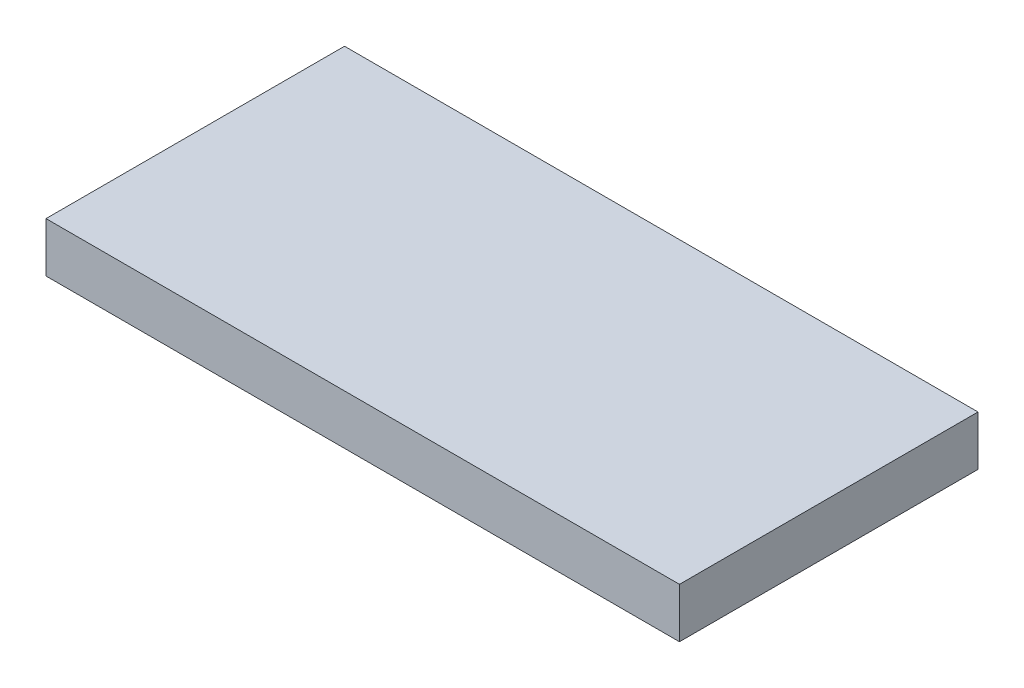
ISO-10303-21;
HEADER;
FILE_DESCRIPTION(('STEP AP214'),'2;1');
FILE_NAME('part.step','',(''),(''),'','','');
FILE_SCHEMA(('AUTOMOTIVE_DESIGN { 1 0 10303 214 1 1 1 1 }'));
ENDSEC;
DATA;
#1=APPLICATION_CONTEXT('core data for automotive mechanical design processes');
#2=APPLICATION_PROTOCOL_DEFINITION('international standard','automotive_design',2000,#1);
#3=PRODUCT_CONTEXT('',#1,'mechanical');
#4=PRODUCT('Part','Part','',(#3));
#5=PRODUCT_RELATED_PRODUCT_CATEGORY('part','',(#4));
#6=PRODUCT_DEFINITION_FORMATION('','',#4);
#7=PRODUCT_DEFINITION_CONTEXT('part definition',#1,'design');
#8=PRODUCT_DEFINITION('design','',#6,#7);
#9=PRODUCT_DEFINITION_SHAPE('','',#8);
#10=(LENGTH_UNIT() NAMED_UNIT(*) SI_UNIT(.MILLI.,.METRE.));
#11=(NAMED_UNIT(*) PLANE_ANGLE_UNIT() SI_UNIT($,.RADIAN.));
#12=(NAMED_UNIT(*) SI_UNIT($,.STERADIAN.) SOLID_ANGLE_UNIT());
#13=UNCERTAINTY_MEASURE_WITH_UNIT(LENGTH_MEASURE(1.E-05),#10,'distance_accuracy_value','');
#14=(GEOMETRIC_REPRESENTATION_CONTEXT(3) GLOBAL_UNCERTAINTY_ASSIGNED_CONTEXT((#13)) GLOBAL_UNIT_ASSIGNED_CONTEXT((#10,
#11,#12)) REPRESENTATION_CONTEXT('',''));
#15=CARTESIAN_POINT('',(0.,0.,0.));
#16=DIRECTION('',(0.,0.,1.));
#17=DIRECTION('',(1.,0.,0.));
#18=AXIS2_PLACEMENT_3D('',#15,#16,#17);
#19=CARTESIAN_POINT('',(646.79957,50.8,-304.8));
#20=DIRECTION('',(-1.,0.,0.));
#21=DIRECTION('',(0.,0.,1.));
#22=AXIS2_PLACEMENT_3D('',#19,#20,#21);
#23=PLANE('',#22);
#24=DIRECTION('',(0.,0.,-1.));
#25=VECTOR('',#24,1.);
#26=CARTESIAN_POINT('',(646.79957,-50.8,-304.8));
#27=LINE('',#26,#25);
#28=CARTESIAN_POINT('',(646.79957,-50.8,304.8));
#29=VERTEX_POINT('',#28);
#30=CARTESIAN_POINT('',(646.79957,-50.8,-304.8));
#31=VERTEX_POINT('',#30);
#32=EDGE_CURVE('E96',#29,#31,#27,.T.);
#33=ORIENTED_EDGE('',*,*,#32,.T.);
#34=DIRECTION('',(0.,-1.,0.));
#35=VECTOR('',#34,1.);
#36=CARTESIAN_POINT('',(646.79957,50.8,-304.8));
#37=LINE('',#36,#35);
#38=CARTESIAN_POINT('',(646.79957,50.8,-304.8));
#39=VERTEX_POINT('',#38);
#40=EDGE_CURVE('E11',#39,#31,#37,.T.);
#41=ORIENTED_EDGE('',*,*,#40,.F.);
#42=DIRECTION('',(0.,0.,-1.));
#43=VECTOR('',#42,1.);
#44=CARTESIAN_POINT('',(646.79957,50.8,-304.8));
#45=LINE('',#44,#43);
#46=CARTESIAN_POINT('',(646.79957,50.8,304.8));
#47=VERTEX_POINT('',#46);
#48=EDGE_CURVE('E84',#47,#39,#45,.T.);
#49=ORIENTED_EDGE('',*,*,#48,.F.);
#50=DIRECTION('',(0.,-1.,0.));
#51=VECTOR('',#50,1.);
#52=CARTESIAN_POINT('',(646.79957,50.8,304.8));
#53=LINE('',#52,#51);
#54=EDGE_CURVE('E92',#47,#29,#53,.T.);
#55=ORIENTED_EDGE('',*,*,#54,.T.);
#56=EDGE_LOOP('',(#33,#41,#49,#55));
#57=FACE_BOUND('',#56,.T.);
#58=ADVANCED_FACE('F33',(#57),#23,.F.);
#59=CARTESIAN_POINT('',(-646.79957,50.8,-304.8));
#60=DIRECTION('',(0.,0.,1.));
#61=DIRECTION('',(1.,0.,0.));
#62=AXIS2_PLACEMENT_3D('',#59,#60,#61);
#63=PLANE('',#62);
#64=DIRECTION('',(-1.,0.,0.));
#65=VECTOR('',#64,1.);
#66=CARTESIAN_POINT('',(-646.79957,-50.8,-304.8));
#67=LINE('',#66,#65);
#68=CARTESIAN_POINT('',(-646.79957,-50.8,-304.8));
#69=VERTEX_POINT('',#68);
#70=EDGE_CURVE('E88',#31,#69,#67,.T.);
#71=ORIENTED_EDGE('',*,*,#70,.T.);
#72=DIRECTION('',(0.,-1.,0.));
#73=VECTOR('',#72,1.);
#74=CARTESIAN_POINT('',(-646.79957,50.8,-304.8));
#75=LINE('',#74,#73);
#76=CARTESIAN_POINT('',(-646.79957,50.8,-304.8));
#77=VERTEX_POINT('',#76);
#78=EDGE_CURVE('E41',#77,#69,#75,.T.);
#79=ORIENTED_EDGE('',*,*,#78,.F.);
#80=DIRECTION('',(-1.,0.,0.));
#81=VECTOR('',#80,1.);
#82=CARTESIAN_POINT('',(-646.79957,50.8,-304.8));
#83=LINE('',#82,#81);
#84=EDGE_CURVE('E79',#39,#77,#83,.T.);
#85=ORIENTED_EDGE('',*,*,#84,.F.);
#86=ORIENTED_EDGE('',*,*,#40,.T.);
#87=EDGE_LOOP('',(#71,#79,#85,#86));
#88=FACE_BOUND('',#87,.T.);
#89=ADVANCED_FACE('F87',(#88),#63,.F.);
#90=CARTESIAN_POINT('',(-646.79957,50.8,-304.8));
#91=DIRECTION('',(1.,0.,0.));
#92=DIRECTION('',(0.,0.,-1.));
#93=AXIS2_PLACEMENT_3D('',#90,#91,#92);
#94=PLANE('',#93);
#95=DIRECTION('',(0.,0.,1.));
#96=VECTOR('',#95,1.);
#97=CARTESIAN_POINT('',(-646.79957,-50.8,-304.8));
#98=LINE('',#97,#96);
#99=CARTESIAN_POINT('',(-646.79957,-50.8,304.8));
#100=VERTEX_POINT('',#99);
#101=EDGE_CURVE('E66',#69,#100,#98,.T.);
#102=ORIENTED_EDGE('',*,*,#101,.T.);
#103=DIRECTION('',(0.,-1.,0.));
#104=VECTOR('',#103,1.);
#105=CARTESIAN_POINT('',(-646.79957,50.8,304.8));
#106=LINE('',#105,#104);
#107=CARTESIAN_POINT('',(-646.79957,50.8,304.8));
#108=VERTEX_POINT('',#107);
#109=EDGE_CURVE('E89',#108,#100,#106,.T.);
#110=ORIENTED_EDGE('',*,*,#109,.F.);
#111=DIRECTION('',(0.,0.,1.));
#112=VECTOR('',#111,1.);
#113=CARTESIAN_POINT('',(-646.79957,50.8,-304.8));
#114=LINE('',#113,#112);
#115=EDGE_CURVE('E82',#77,#108,#114,.T.);
#116=ORIENTED_EDGE('',*,*,#115,.F.);
#117=ORIENTED_EDGE('',*,*,#78,.T.);
#118=EDGE_LOOP('',(#102,#110,#116,#117));
#119=FACE_BOUND('',#118,.T.);
#120=ADVANCED_FACE('F90',(#119),#94,.F.);
#121=CARTESIAN_POINT('',(-646.79957,50.8,304.8));
#122=DIRECTION('',(0.,0.,-1.));
#123=DIRECTION('',(-1.,0.,0.));
#124=AXIS2_PLACEMENT_3D('',#121,#122,#123);
#125=PLANE('',#124);
#126=DIRECTION('',(1.,0.,0.));
#127=VECTOR('',#126,1.);
#128=CARTESIAN_POINT('',(-646.79957,-50.8,304.8));
#129=LINE('',#128,#127);
#130=EDGE_CURVE('E72',#100,#29,#129,.T.);
#131=ORIENTED_EDGE('',*,*,#130,.T.);
#132=ORIENTED_EDGE('',*,*,#54,.F.);
#133=DIRECTION('',(1.,0.,0.));
#134=VECTOR('',#133,1.);
#135=CARTESIAN_POINT('',(-646.79957,50.8,304.8));
#136=LINE('',#135,#134);
#137=EDGE_CURVE('E49',#108,#47,#136,.T.);
#138=ORIENTED_EDGE('',*,*,#137,.F.);
#139=ORIENTED_EDGE('',*,*,#109,.T.);
#140=EDGE_LOOP('',(#131,#132,#138,#139));
#141=FACE_BOUND('',#140,.T.);
#142=ADVANCED_FACE('F103',(#141),#125,.F.);
#143=CARTESIAN_POINT('',(646.79957,50.8,304.8));
#144=DIRECTION('',(0.,1.,0.));
#145=DIRECTION('',(0.,0.,1.));
#146=AXIS2_PLACEMENT_3D('',#143,#144,#145);
#147=PLANE('',#146);
#148=ORIENTED_EDGE('',*,*,#48,.T.);
#149=ORIENTED_EDGE('',*,*,#84,.T.);
#150=ORIENTED_EDGE('',*,*,#115,.T.);
#151=ORIENTED_EDGE('',*,*,#137,.T.);
#152=EDGE_LOOP('',(#148,#149,#150,#151));
#153=FACE_BOUND('',#152,.T.);
#154=ADVANCED_FACE('F80',(#153),#147,.T.);
#155=CARTESIAN_POINT('',(646.79957,-50.8,304.8));
#156=DIRECTION('',(0.,1.,0.));
#157=DIRECTION('',(0.,0.,1.));
#158=AXIS2_PLACEMENT_3D('',#155,#156,#157);
#159=PLANE('',#158);
#160=ORIENTED_EDGE('',*,*,#32,.F.);
#161=ORIENTED_EDGE('',*,*,#130,.F.);
#162=ORIENTED_EDGE('',*,*,#101,.F.);
#163=ORIENTED_EDGE('',*,*,#70,.F.);
#164=EDGE_LOOP('',(#160,#161,#162,#163));
#165=FACE_BOUND('',#164,.T.);
#166=ADVANCED_FACE('F106',(#165),#159,.F.);
#167=CLOSED_SHELL('',(#58,#89,#120,#142,#154,#166));
#168=MANIFOLD_SOLID_BREP('B2',#167);
#169=ADVANCED_BREP_SHAPE_REPRESENTATION('',(#18,#168),#14);
#170=SHAPE_DEFINITION_REPRESENTATION(#9,#169);
ENDSEC;
END-ISO-10303-21;
